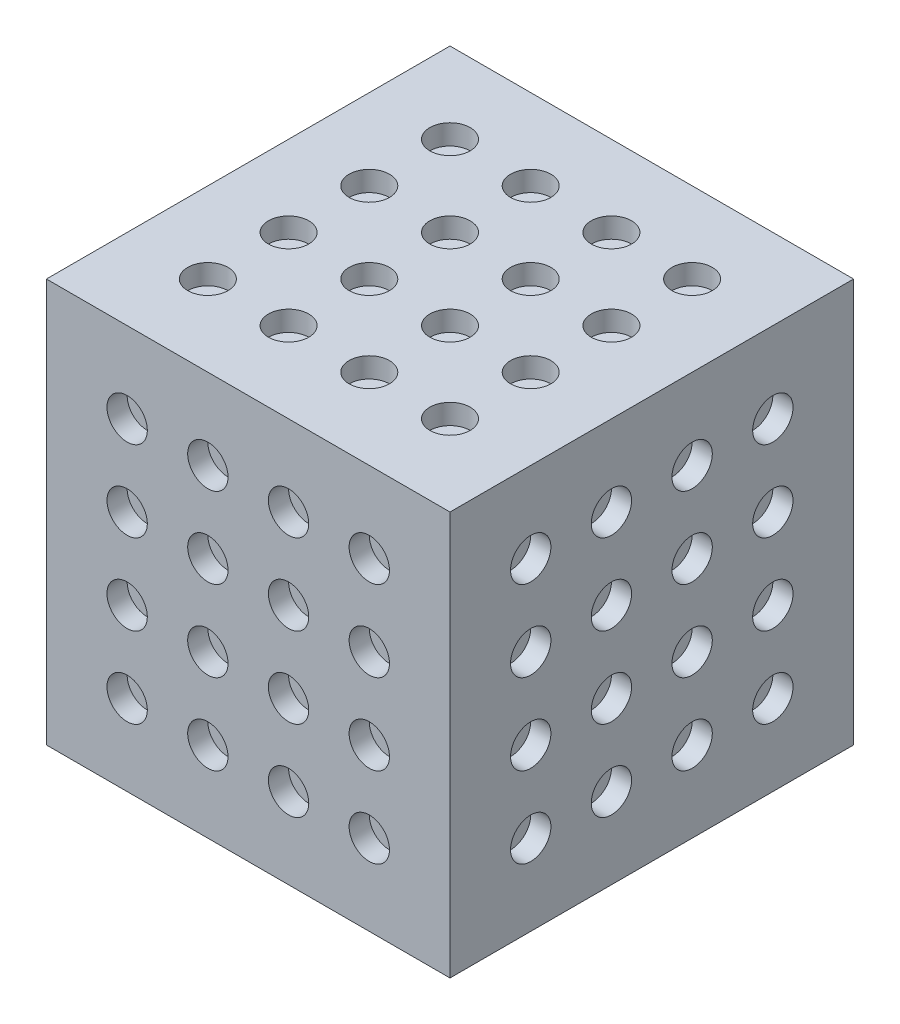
from build123d import *

# Parameters (mm, degrees)
SKIZZE1_W                   = 100
SKIZZE1_H                   = 100
LINEAR_AUSTRAGEN1_DEPTH     = 100
SKIZZE2_R                   = 5
LINEAR_AUSTRAGEN2_DEPTH     = 5
LINEARES_MUSTER1_COUNT      = 4
LINEARES_MUSTER1_PITCH      = 20
LINEARES_MUSTER1_COUNT_DIR2 = 4
LINEARES_MUSTER1_PITCH_DIR2 = 20
SKIZZE3_R                   = 5
LINEAR_AUSTRAGEN3_DEPTH     = 5
LINEARES_MUSTER2_COUNT      = 4
LINEARES_MUSTER2_PITCH      = 20
LINEARES_MUSTER2_COUNT_DIR2 = 4
LINEARES_MUSTER2_PITCH_DIR2 = 20
SKIZZE4_R                   = 5
LINEAR_AUSTRAGEN4_DEPTH     = 5
LINEARES_MUSTER3_COUNT      = 4
LINEARES_MUSTER3_PITCH      = 20
LINEARES_MUSTER3_COUNT_DIR2 = 4
LINEARES_MUSTER3_PITCH_DIR2 = 20


with BuildPart() as part:
    # Skizze1 → Linear austragen1 (new body)
    with BuildSketch(Plane.XY):
        with Locations((50, 50)):
            Rectangle(SKIZZE1_W, SKIZZE1_H)
    extrude(amount=LINEAR_AUSTRAGEN1_DEPTH)

    # Skizze2 → Linear austragen2 (cut)
    with BuildSketch(Plane.XY.offset(100)):
        with Locations((20, 80)):
            Circle(SKIZZE2_R)
    linear_austragen2 = extrude(amount=-LINEAR_AUSTRAGEN2_DEPTH, mode=Mode.SUBTRACT)

    # Lineares Muster1: Linear austragen2 4 × 4
    with Locations(*[(i * LINEARES_MUSTER1_PITCH, -j * LINEARES_MUSTER1_PITCH_DIR2, 0) for i in range(LINEARES_MUSTER1_COUNT) for j in range(LINEARES_MUSTER1_COUNT_DIR2) if (i, j) != (0, 0)]):
        add(linear_austragen2, mode=Mode.SUBTRACT)

    # Skizze3 → Linear austragen3 (cut)
    with BuildSketch(Plane(origin=(100, 0, 0), x_dir=(0, 0, -1), z_dir=(1, 0, 0))):
        with Locations((-80, 80)):
            Circle(SKIZZE3_R)
    linear_austragen3 = extrude(amount=-LINEAR_AUSTRAGEN3_DEPTH, mode=Mode.SUBTRACT)

    # Lineares Muster2: Linear austragen3 4 × 4
    with Locations(*[(0, -j * LINEARES_MUSTER2_PITCH_DIR2, -i * LINEARES_MUSTER2_PITCH) for i in range(LINEARES_MUSTER2_COUNT) for j in range(LINEARES_MUSTER2_COUNT_DIR2) if (i, j) != (0, 0)]):
        add(linear_austragen3, mode=Mode.SUBTRACT)

    # Skizze4 → Linear austragen4 (cut)
    with BuildSketch(Plane(origin=(0, 100, 0), x_dir=(-1, 0, 0), z_dir=(0, 1, 0))):
        with Locations(Location((-20, 80, 0), (0, 0, 90))):
            Circle(SKIZZE4_R)
    linear_austragen4 = extrude(amount=-LINEAR_AUSTRAGEN4_DEPTH, mode=Mode.SUBTRACT)

    # Lineares Muster3: Linear austragen4 4 × 4
    with Locations(*[(j * LINEARES_MUSTER3_PITCH_DIR2, 0, -i * LINEARES_MUSTER3_PITCH) for i in range(LINEARES_MUSTER3_COUNT) for j in range(LINEARES_MUSTER3_COUNT_DIR2) if (i, j) != (0, 0)]):
        add(linear_austragen4, mode=Mode.SUBTRACT)


solid = part.part
